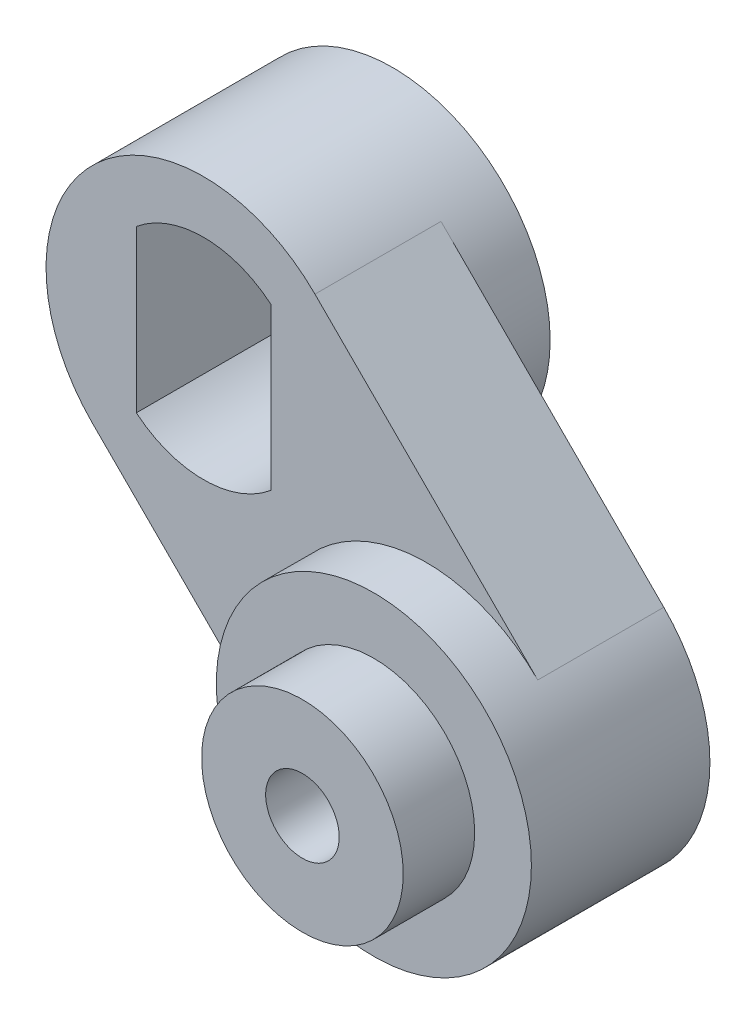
ISO-10303-21;
HEADER;
FILE_DESCRIPTION(('STEP AP214'),'2;1');
FILE_NAME('part.step','',(''),(''),'','','');
FILE_SCHEMA(('AUTOMOTIVE_DESIGN { 1 0 10303 214 1 1 1 1 }'));
ENDSEC;
DATA;
#1=APPLICATION_CONTEXT('core data for automotive mechanical design processes');
#2=APPLICATION_PROTOCOL_DEFINITION('international standard','automotive_design',2000,#1);
#3=PRODUCT_CONTEXT('',#1,'mechanical');
#4=PRODUCT('Part','Part','',(#3));
#5=PRODUCT_RELATED_PRODUCT_CATEGORY('part','',(#4));
#6=PRODUCT_DEFINITION_FORMATION('','',#4);
#7=PRODUCT_DEFINITION_CONTEXT('part definition',#1,'design');
#8=PRODUCT_DEFINITION('design','',#6,#7);
#9=PRODUCT_DEFINITION_SHAPE('','',#8);
#10=(LENGTH_UNIT() NAMED_UNIT(*) SI_UNIT(.MILLI.,.METRE.));
#11=(NAMED_UNIT(*) PLANE_ANGLE_UNIT() SI_UNIT($,.RADIAN.));
#12=(NAMED_UNIT(*) SI_UNIT($,.STERADIAN.) SOLID_ANGLE_UNIT());
#13=UNCERTAINTY_MEASURE_WITH_UNIT(LENGTH_MEASURE(1.E-05),#10,'distance_accuracy_value','');
#14=(GEOMETRIC_REPRESENTATION_CONTEXT(3) GLOBAL_UNCERTAINTY_ASSIGNED_CONTEXT((#13)) GLOBAL_UNIT_ASSIGNED_CONTEXT((#10,
#11,#12)) REPRESENTATION_CONTEXT('',''));
#15=CARTESIAN_POINT('',(0.,0.,0.));
#16=DIRECTION('',(0.,0.,1.));
#17=DIRECTION('',(1.,0.,0.));
#18=AXIS2_PLACEMENT_3D('',#15,#16,#17);
#19=CARTESIAN_POINT('',(0.,0.,9.));
#20=DIRECTION('',(0.,0.,-1.));
#21=DIRECTION('',(-1.,0.,0.));
#22=AXIS2_PLACEMENT_3D('',#19,#20,#21);
#23=CYLINDRICAL_SURFACE('',#22,7.5);
#24=CARTESIAN_POINT('',(0.,0.,0.));
#25=DIRECTION('',(0.,0.,1.));
#26=DIRECTION('',(1.,0.,0.));
#27=AXIS2_PLACEMENT_3D('',#24,#25,#26);
#28=CIRCLE('',#27,7.5);
#29=CARTESIAN_POINT('',(7.5,0.,0.));
#30=VERTEX_POINT('',#29);
#31=EDGE_CURVE('E42',#30,#30,#28,.T.);
#32=ORIENTED_EDGE('',*,*,#31,.T.);
#33=EDGE_LOOP('',(#32));
#34=FACE_BOUND('',#33,.T.);
#35=DIRECTION('',(0.,0.,1.));
#36=VECTOR('',#35,1.);
#37=CARTESIAN_POINT('',(-5.30330085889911,-5.3033008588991,3.));
#38=LINE('',#37,#36);
#39=CARTESIAN_POINT('',(-5.30330085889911,-5.3033008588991,3.));
#40=VERTEX_POINT('',#39);
#41=CARTESIAN_POINT('',(-5.30330085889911,-5.3033008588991,9.));
#42=VERTEX_POINT('',#41);
#43=EDGE_CURVE('E144',#40,#42,#38,.T.);
#44=ORIENTED_EDGE('',*,*,#43,.T.);
#45=CARTESIAN_POINT('',(0.,0.,9.));
#46=DIRECTION('',(0.,0.,1.));
#47=DIRECTION('',(1.,0.,0.));
#48=AXIS2_PLACEMENT_3D('',#45,#46,#47);
#49=CIRCLE('',#48,7.5);
#50=CARTESIAN_POINT('',(5.30330085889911,5.3033008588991,9.));
#51=VERTEX_POINT('',#50);
#52=EDGE_CURVE('E47',#51,#42,#49,.T.);
#53=ORIENTED_EDGE('',*,*,#52,.F.);
#54=DIRECTION('',(0.,0.,1.));
#55=VECTOR('',#54,1.);
#56=CARTESIAN_POINT('',(5.30330085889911,5.3033008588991,3.));
#57=LINE('',#56,#55);
#58=CARTESIAN_POINT('',(5.30330085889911,5.3033008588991,3.));
#59=VERTEX_POINT('',#58);
#60=EDGE_CURVE('E110',#59,#51,#57,.T.);
#61=ORIENTED_EDGE('',*,*,#60,.F.);
#62=CARTESIAN_POINT('',(0.,0.,3.));
#63=DIRECTION('',(0.,0.,1.));
#64=DIRECTION('',(1.,0.,0.));
#65=AXIS2_PLACEMENT_3D('',#62,#63,#64);
#66=CIRCLE('',#65,7.5);
#67=EDGE_CURVE('E141',#40,#59,#66,.T.);
#68=ORIENTED_EDGE('',*,*,#67,.F.);
#69=EDGE_LOOP('',(#44,#53,#61,#68));
#70=FACE_BOUND('',#69,.T.);
#71=ADVANCED_FACE('F39',(#34,#70),#23,.T.);
#72=CARTESIAN_POINT('',(0.,0.,9.));
#73=DIRECTION('',(0.,0.,1.));
#74=DIRECTION('',(1.,0.,0.));
#75=AXIS2_PLACEMENT_3D('',#72,#73,#74);
#76=PLANE('',#75);
#77=CARTESIAN_POINT('',(10.6066017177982,-10.6066017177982,9.));
#78=DIRECTION('',(0.,0.,1.));
#79=DIRECTION('',(1.,0.,0.));
#80=AXIS2_PLACEMENT_3D('',#77,#78,#79);
#81=CIRCLE('',#80,7.5);
#82=CARTESIAN_POINT('',(15.9099025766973,-5.30330085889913,9.));
#83=VERTEX_POINT('',#82);
#84=CARTESIAN_POINT('',(5.30330085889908,-15.9099025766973,9.));
#85=VERTEX_POINT('',#84);
#86=EDGE_CURVE('E120',#83,#85,#81,.T.);
#87=ORIENTED_EDGE('',*,*,#86,.F.);
#88=DIRECTION('',(-0.707106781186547,0.707106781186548,0.));
#89=VECTOR('',#88,1.);
#90=CARTESIAN_POINT('',(5.30330085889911,5.3033008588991,9.));
#91=LINE('',#90,#89);
#92=EDGE_CURVE('E55',#83,#51,#91,.T.);
#93=ORIENTED_EDGE('',*,*,#92,.T.);
#94=ORIENTED_EDGE('',*,*,#52,.T.);
#95=DIRECTION('',(-0.707106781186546,0.707106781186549,0.));
#96=VECTOR('',#95,1.);
#97=CARTESIAN_POINT('',(-5.30330085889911,-5.3033008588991,9.));
#98=LINE('',#97,#96);
#99=EDGE_CURVE('E113',#85,#42,#98,.T.);
#100=ORIENTED_EDGE('',*,*,#99,.F.);
#101=EDGE_LOOP('',(#87,#93,#94,#100));
#102=FACE_BOUND('',#101,.T.);
#103=DIRECTION('',(0.,-1.,0.));
#104=VECTOR('',#103,1.);
#105=CARTESIAN_POINT('',(-3.2,0.,9.));
#106=LINE('',#105,#104);
#107=CARTESIAN_POINT('',(-3.2,3.84187454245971,9.));
#108=VERTEX_POINT('',#107);
#109=CARTESIAN_POINT('',(-3.2,-3.84187454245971,9.));
#110=VERTEX_POINT('',#109);
#111=EDGE_CURVE('E155',#108,#110,#106,.T.);
#112=ORIENTED_EDGE('',*,*,#111,.F.);
#113=CARTESIAN_POINT('',(0.,0.,9.));
#114=DIRECTION('',(0.,0.,1.));
#115=DIRECTION('',(1.,0.,0.));
#116=AXIS2_PLACEMENT_3D('',#113,#114,#115);
#117=CIRCLE('',#116,5.);
#118=CARTESIAN_POINT('',(3.2,3.84187454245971,9.));
#119=VERTEX_POINT('',#118);
#120=EDGE_CURVE('E152',#119,#108,#117,.T.);
#121=ORIENTED_EDGE('',*,*,#120,.F.);
#122=DIRECTION('',(0.,1.,0.));
#123=VECTOR('',#122,1.);
#124=CARTESIAN_POINT('',(3.2,0.,9.));
#125=LINE('',#124,#123);
#126=CARTESIAN_POINT('',(3.2,-3.84187454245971,9.));
#127=VERTEX_POINT('',#126);
#128=EDGE_CURVE('E150',#127,#119,#125,.T.);
#129=ORIENTED_EDGE('',*,*,#128,.F.);
#130=CARTESIAN_POINT('',(0.,0.,9.));
#131=DIRECTION('',(0.,0.,1.));
#132=DIRECTION('',(1.,0.,0.));
#133=AXIS2_PLACEMENT_3D('',#130,#131,#132);
#134=CIRCLE('',#133,5.);
#135=EDGE_CURVE('E157',#110,#127,#134,.T.);
#136=ORIENTED_EDGE('',*,*,#135,.F.);
#137=EDGE_LOOP('',(#112,#121,#129,#136));
#138=FACE_BOUND('',#137,.T.);
#139=ADVANCED_FACE('F126',(#102,#138),#76,.T.);
#140=CARTESIAN_POINT('',(0.,0.,0.));
#141=DIRECTION('',(0.,0.,1.));
#142=DIRECTION('',(1.,0.,0.));
#143=AXIS2_PLACEMENT_3D('',#140,#141,#142);
#144=PLANE('',#143);
#145=ORIENTED_EDGE('',*,*,#31,.F.);
#146=EDGE_LOOP('',(#145));
#147=FACE_BOUND('',#146,.T.);
#148=CARTESIAN_POINT('',(0.,0.,0.));
#149=DIRECTION('',(0.,0.,1.));
#150=DIRECTION('',(1.,0.,0.));
#151=AXIS2_PLACEMENT_3D('',#148,#149,#150);
#152=CIRCLE('',#151,5.);
#153=CARTESIAN_POINT('',(3.2,3.84187454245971,0.));
#154=VERTEX_POINT('',#153);
#155=CARTESIAN_POINT('',(-3.2,3.84187454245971,0.));
#156=VERTEX_POINT('',#155);
#157=EDGE_CURVE('E147',#154,#156,#152,.T.);
#158=ORIENTED_EDGE('',*,*,#157,.T.);
#159=DIRECTION('',(0.,-1.,0.));
#160=VECTOR('',#159,1.);
#161=CARTESIAN_POINT('',(-3.2,0.,0.));
#162=LINE('',#161,#160);
#163=CARTESIAN_POINT('',(-3.2,-3.84187454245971,0.));
#164=VERTEX_POINT('',#163);
#165=EDGE_CURVE('E161',#156,#164,#162,.T.);
#166=ORIENTED_EDGE('',*,*,#165,.T.);
#167=CARTESIAN_POINT('',(0.,0.,0.));
#168=DIRECTION('',(0.,0.,1.));
#169=DIRECTION('',(1.,0.,0.));
#170=AXIS2_PLACEMENT_3D('',#167,#168,#169);
#171=CIRCLE('',#170,5.);
#172=CARTESIAN_POINT('',(3.2,-3.84187454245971,0.));
#173=VERTEX_POINT('',#172);
#174=EDGE_CURVE('E164',#164,#173,#171,.T.);
#175=ORIENTED_EDGE('',*,*,#174,.T.);
#176=DIRECTION('',(0.,1.,0.));
#177=VECTOR('',#176,1.);
#178=CARTESIAN_POINT('',(3.2,0.,0.));
#179=LINE('',#178,#177);
#180=EDGE_CURVE('E153',#173,#154,#179,.T.);
#181=ORIENTED_EDGE('',*,*,#180,.T.);
#182=EDGE_LOOP('',(#158,#166,#175,#181));
#183=FACE_BOUND('',#182,.T.);
#184=ADVANCED_FACE('F181',(#147,#183),#144,.F.);
#185=CARTESIAN_POINT('',(0.,0.,9.));
#186=DIRECTION('',(0.,0.,-1.));
#187=DIRECTION('',(-1.,0.,0.));
#188=AXIS2_PLACEMENT_3D('',#185,#186,#187);
#189=CYLINDRICAL_SURFACE('',#188,5.);
#190=ORIENTED_EDGE('',*,*,#157,.F.);
#191=DIRECTION('',(0.,0.,-1.));
#192=VECTOR('',#191,1.);
#193=CARTESIAN_POINT('',(3.2,3.84187454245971,9.));
#194=LINE('',#193,#192);
#195=EDGE_CURVE('E175',#119,#154,#194,.T.);
#196=ORIENTED_EDGE('',*,*,#195,.F.);
#197=ORIENTED_EDGE('',*,*,#120,.T.);
#198=DIRECTION('',(0.,0.,-1.));
#199=VECTOR('',#198,1.);
#200=CARTESIAN_POINT('',(-3.2,3.84187454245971,9.));
#201=LINE('',#200,#199);
#202=EDGE_CURVE('E172',#108,#156,#201,.T.);
#203=ORIENTED_EDGE('',*,*,#202,.T.);
#204=EDGE_LOOP('',(#190,#196,#197,#203));
#205=FACE_BOUND('',#204,.T.);
#206=ADVANCED_FACE('F184',(#205),#189,.F.);
#207=CARTESIAN_POINT('',(-3.2,0.,9.));
#208=DIRECTION('',(1.,0.,0.));
#209=DIRECTION('',(0.,0.,-1.));
#210=AXIS2_PLACEMENT_3D('',#207,#208,#209);
#211=PLANE('',#210);
#212=ORIENTED_EDGE('',*,*,#165,.F.);
#213=ORIENTED_EDGE('',*,*,#202,.F.);
#214=ORIENTED_EDGE('',*,*,#111,.T.);
#215=DIRECTION('',(0.,0.,-1.));
#216=VECTOR('',#215,1.);
#217=CARTESIAN_POINT('',(-3.2,-3.84187454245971,9.));
#218=LINE('',#217,#216);
#219=EDGE_CURVE('E170',#110,#164,#218,.T.);
#220=ORIENTED_EDGE('',*,*,#219,.T.);
#221=EDGE_LOOP('',(#212,#213,#214,#220));
#222=FACE_BOUND('',#221,.T.);
#223=ADVANCED_FACE('F192',(#222),#211,.T.);
#224=CARTESIAN_POINT('',(0.,0.,9.));
#225=DIRECTION('',(0.,0.,-1.));
#226=DIRECTION('',(-1.,0.,0.));
#227=AXIS2_PLACEMENT_3D('',#224,#225,#226);
#228=CYLINDRICAL_SURFACE('',#227,5.);
#229=ORIENTED_EDGE('',*,*,#174,.F.);
#230=ORIENTED_EDGE('',*,*,#219,.F.);
#231=ORIENTED_EDGE('',*,*,#135,.T.);
#232=DIRECTION('',(0.,0.,-1.));
#233=VECTOR('',#232,1.);
#234=CARTESIAN_POINT('',(3.2,-3.84187454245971,9.));
#235=LINE('',#234,#233);
#236=EDGE_CURVE('E63',#127,#173,#235,.T.);
#237=ORIENTED_EDGE('',*,*,#236,.T.);
#238=EDGE_LOOP('',(#229,#230,#231,#237));
#239=FACE_BOUND('',#238,.T.);
#240=ADVANCED_FACE('F198',(#239),#228,.F.);
#241=CARTESIAN_POINT('',(3.2,0.,9.));
#242=DIRECTION('',(-1.,0.,0.));
#243=DIRECTION('',(0.,0.,1.));
#244=AXIS2_PLACEMENT_3D('',#241,#242,#243);
#245=PLANE('',#244);
#246=ORIENTED_EDGE('',*,*,#180,.F.);
#247=ORIENTED_EDGE('',*,*,#236,.F.);
#248=ORIENTED_EDGE('',*,*,#128,.T.);
#249=ORIENTED_EDGE('',*,*,#195,.T.);
#250=EDGE_LOOP('',(#246,#247,#248,#249));
#251=FACE_BOUND('',#250,.T.);
#252=ADVANCED_FACE('F199',(#251),#245,.T.);
#253=CARTESIAN_POINT('',(-5.30330085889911,-5.3033008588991,3.));
#254=DIRECTION('',(0.707106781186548,0.707106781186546,0.));
#255=DIRECTION('',(-0.707106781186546,0.707106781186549,0.));
#256=AXIS2_PLACEMENT_3D('',#253,#254,#255);
#257=PLANE('',#256);
#258=ORIENTED_EDGE('',*,*,#99,.T.);
#259=ORIENTED_EDGE('',*,*,#43,.F.);
#260=DIRECTION('',(-0.707106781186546,0.707106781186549,0.));
#261=VECTOR('',#260,1.);
#262=CARTESIAN_POINT('',(-5.30330085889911,-5.3033008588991,3.));
#263=LINE('',#262,#261);
#264=CARTESIAN_POINT('',(5.30330085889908,-15.9099025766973,3.));
#265=VERTEX_POINT('',#264);
#266=EDGE_CURVE('E112',#265,#40,#263,.T.);
#267=ORIENTED_EDGE('',*,*,#266,.F.);
#268=DIRECTION('',(0.,0.,1.));
#269=VECTOR('',#268,1.);
#270=CARTESIAN_POINT('',(5.30330085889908,-15.9099025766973,3.));
#271=LINE('',#270,#269);
#272=EDGE_CURVE('E123',#265,#85,#271,.T.);
#273=ORIENTED_EDGE('',*,*,#272,.T.);
#274=EDGE_LOOP('',(#258,#259,#267,#273));
#275=FACE_BOUND('',#274,.T.);
#276=ADVANCED_FACE('F201',(#275),#257,.F.);
#277=CARTESIAN_POINT('',(5.30330085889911,5.3033008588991,3.));
#278=DIRECTION('',(0.707106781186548,0.707106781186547,0.));
#279=DIRECTION('',(-0.707106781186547,0.707106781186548,0.));
#280=AXIS2_PLACEMENT_3D('',#277,#278,#279);
#281=PLANE('',#280);
#282=ORIENTED_EDGE('',*,*,#92,.F.);
#283=DIRECTION('',(0.,0.,1.));
#284=VECTOR('',#283,1.);
#285=CARTESIAN_POINT('',(15.9099025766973,-5.30330085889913,3.));
#286=LINE('',#285,#284);
#287=CARTESIAN_POINT('',(15.9099025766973,-5.30330085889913,3.));
#288=VERTEX_POINT('',#287);
#289=EDGE_CURVE('E107',#288,#83,#286,.T.);
#290=ORIENTED_EDGE('',*,*,#289,.F.);
#291=DIRECTION('',(-0.707106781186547,0.707106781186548,0.));
#292=VECTOR('',#291,1.);
#293=CARTESIAN_POINT('',(5.30330085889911,5.3033008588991,3.));
#294=LINE('',#293,#292);
#295=EDGE_CURVE('E139',#288,#59,#294,.T.);
#296=ORIENTED_EDGE('',*,*,#295,.T.);
#297=ORIENTED_EDGE('',*,*,#60,.T.);
#298=EDGE_LOOP('',(#282,#290,#296,#297));
#299=FACE_BOUND('',#298,.T.);
#300=ADVANCED_FACE('F105',(#299),#281,.T.);
#301=CARTESIAN_POINT('',(10.6066017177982,-10.6066017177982,3.));
#302=DIRECTION('',(0.,0.,1.));
#303=DIRECTION('',(1.,0.,0.));
#304=AXIS2_PLACEMENT_3D('',#301,#302,#303);
#305=CYLINDRICAL_SURFACE('',#304,7.5);
#306=ORIENTED_EDGE('',*,*,#289,.T.);
#307=ORIENTED_EDGE('',*,*,#86,.T.);
#308=ORIENTED_EDGE('',*,*,#272,.F.);
#309=CARTESIAN_POINT('',(10.6066017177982,-10.6066017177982,3.));
#310=DIRECTION('',(0.,0.,1.));
#311=DIRECTION('',(1.,0.,0.));
#312=AXIS2_PLACEMENT_3D('',#309,#310,#311);
#313=CIRCLE('',#312,7.5);
#314=EDGE_CURVE('E122',#265,#288,#313,.T.);
#315=ORIENTED_EDGE('',*,*,#314,.T.);
#316=EDGE_LOOP('',(#306,#307,#308,#315));
#317=FACE_BOUND('',#316,.T.);
#318=CARTESIAN_POINT('',(10.6066017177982,-10.6066017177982,11.5));
#319=DIRECTION('',(0.,0.,1.));
#320=DIRECTION('',(1.,0.,0.));
#321=AXIS2_PLACEMENT_3D('',#318,#319,#320);
#322=CIRCLE('',#321,7.5);
#323=CARTESIAN_POINT('',(18.1066017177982,-10.6066017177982,11.5));
#324=VERTEX_POINT('',#323);
#325=EDGE_CURVE('E128',#324,#324,#322,.T.);
#326=ORIENTED_EDGE('',*,*,#325,.F.);
#327=EDGE_LOOP('',(#326));
#328=FACE_BOUND('',#327,.T.);
#329=ADVANCED_FACE('F118',(#317,#328),#305,.T.);
#330=CARTESIAN_POINT('',(0.,0.,3.));
#331=DIRECTION('',(0.,0.,1.));
#332=DIRECTION('',(1.,0.,0.));
#333=AXIS2_PLACEMENT_3D('',#330,#331,#332);
#334=PLANE('',#333);
#335=CARTESIAN_POINT('',(10.6066017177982,-10.6066017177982,3.));
#336=DIRECTION('',(0.,0.,1.));
#337=DIRECTION('',(1.,0.,0.));
#338=AXIS2_PLACEMENT_3D('',#335,#336,#337);
#339=CIRCLE('',#338,1.75);
#340=CARTESIAN_POINT('',(12.3566017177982,-10.6066017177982,3.));
#341=VERTEX_POINT('',#340);
#342=EDGE_CURVE('E134',#341,#341,#339,.T.);
#343=ORIENTED_EDGE('',*,*,#342,.T.);
#344=EDGE_LOOP('',(#343));
#345=FACE_BOUND('',#344,.T.);
#346=ORIENTED_EDGE('',*,*,#266,.T.);
#347=ORIENTED_EDGE('',*,*,#67,.T.);
#348=ORIENTED_EDGE('',*,*,#295,.F.);
#349=ORIENTED_EDGE('',*,*,#314,.F.);
#350=EDGE_LOOP('',(#346,#347,#348,#349));
#351=FACE_BOUND('',#350,.T.);
#352=ADVANCED_FACE('F267',(#345,#351),#334,.F.);
#353=CARTESIAN_POINT('',(10.6066017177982,-10.6066017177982,11.5));
#354=DIRECTION('',(0.,0.,1.));
#355=DIRECTION('',(1.,0.,0.));
#356=AXIS2_PLACEMENT_3D('',#353,#354,#355);
#357=PLANE('',#356);
#358=CARTESIAN_POINT('',(10.6066017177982,-10.6066017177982,11.5));
#359=DIRECTION('',(0.,0.,1.));
#360=DIRECTION('',(1.,0.,0.));
#361=AXIS2_PLACEMENT_3D('',#358,#359,#360);
#362=CIRCLE('',#361,4.8);
#363=CARTESIAN_POINT('',(15.4066017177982,-10.6066017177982,11.5));
#364=VERTEX_POINT('',#363);
#365=EDGE_CURVE('E11',#364,#364,#362,.T.);
#366=ORIENTED_EDGE('',*,*,#365,.F.);
#367=EDGE_LOOP('',(#366));
#368=FACE_BOUND('',#367,.T.);
#369=ORIENTED_EDGE('',*,*,#325,.T.);
#370=EDGE_LOOP('',(#369));
#371=FACE_BOUND('',#370,.T.);
#372=ADVANCED_FACE('F275',(#368,#371),#357,.T.);
#373=CARTESIAN_POINT('',(10.6066017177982,-10.6066017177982,14.9));
#374=DIRECTION('',(0.,0.,-1.));
#375=DIRECTION('',(-1.,0.,0.));
#376=AXIS2_PLACEMENT_3D('',#373,#374,#375);
#377=CYLINDRICAL_SURFACE('',#376,4.8);
#378=CARTESIAN_POINT('',(10.6066017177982,-10.6066017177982,14.9));
#379=DIRECTION('',(0.,0.,1.));
#380=DIRECTION('',(1.,0.,0.));
#381=AXIS2_PLACEMENT_3D('',#378,#379,#380);
#382=CIRCLE('',#381,4.8);
#383=CARTESIAN_POINT('',(15.4066017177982,-10.6066017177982,14.9));
#384=VERTEX_POINT('',#383);
#385=EDGE_CURVE('E129',#384,#384,#382,.T.);
#386=ORIENTED_EDGE('',*,*,#385,.F.);
#387=EDGE_LOOP('',(#386));
#388=FACE_BOUND('',#387,.T.);
#389=ORIENTED_EDGE('',*,*,#365,.T.);
#390=EDGE_LOOP('',(#389));
#391=FACE_BOUND('',#390,.T.);
#392=ADVANCED_FACE('F279',(#388,#391),#377,.T.);
#393=CARTESIAN_POINT('',(10.6066017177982,-10.6066017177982,14.9));
#394=DIRECTION('',(0.,0.,1.));
#395=DIRECTION('',(1.,0.,0.));
#396=AXIS2_PLACEMENT_3D('',#393,#394,#395);
#397=PLANE('',#396);
#398=CARTESIAN_POINT('',(10.6066017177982,-10.6066017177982,14.9));
#399=DIRECTION('',(0.,0.,1.));
#400=DIRECTION('',(1.,0.,0.));
#401=AXIS2_PLACEMENT_3D('',#398,#399,#400);
#402=CIRCLE('',#401,1.75);
#403=CARTESIAN_POINT('',(12.3566017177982,-10.6066017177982,14.9));
#404=VERTEX_POINT('',#403);
#405=EDGE_CURVE('E323',#404,#404,#402,.T.);
#406=ORIENTED_EDGE('',*,*,#405,.F.);
#407=EDGE_LOOP('',(#406));
#408=FACE_BOUND('',#407,.T.);
#409=ORIENTED_EDGE('',*,*,#385,.T.);
#410=EDGE_LOOP('',(#409));
#411=FACE_BOUND('',#410,.T.);
#412=ADVANCED_FACE('F289',(#408,#411),#397,.T.);
#413=CARTESIAN_POINT('',(10.6066017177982,-10.6066017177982,-4.5));
#414=DIRECTION('',(0.,0.,1.));
#415=DIRECTION('',(1.,0.,0.));
#416=AXIS2_PLACEMENT_3D('',#413,#414,#415);
#417=CYLINDRICAL_SURFACE('',#416,1.75);
#418=ORIENTED_EDGE('',*,*,#405,.T.);
#419=EDGE_LOOP('',(#418));
#420=FACE_BOUND('',#419,.T.);
#421=ORIENTED_EDGE('',*,*,#342,.F.);
#422=EDGE_LOOP('',(#421));
#423=FACE_BOUND('',#422,.T.);
#424=ADVANCED_FACE('F306',(#420,#423),#417,.F.);
#425=CLOSED_SHELL('',(#71,#139,#184,#206,#223,#240,#252,#276,#300,#329,#352,#372,#392,#412,#424));
#426=MANIFOLD_SOLID_BREP('B2',#425);
#427=ADVANCED_BREP_SHAPE_REPRESENTATION('',(#18,#426),#14);
#428=SHAPE_DEFINITION_REPRESENTATION(#9,#427);
ENDSEC;
END-ISO-10303-21;
